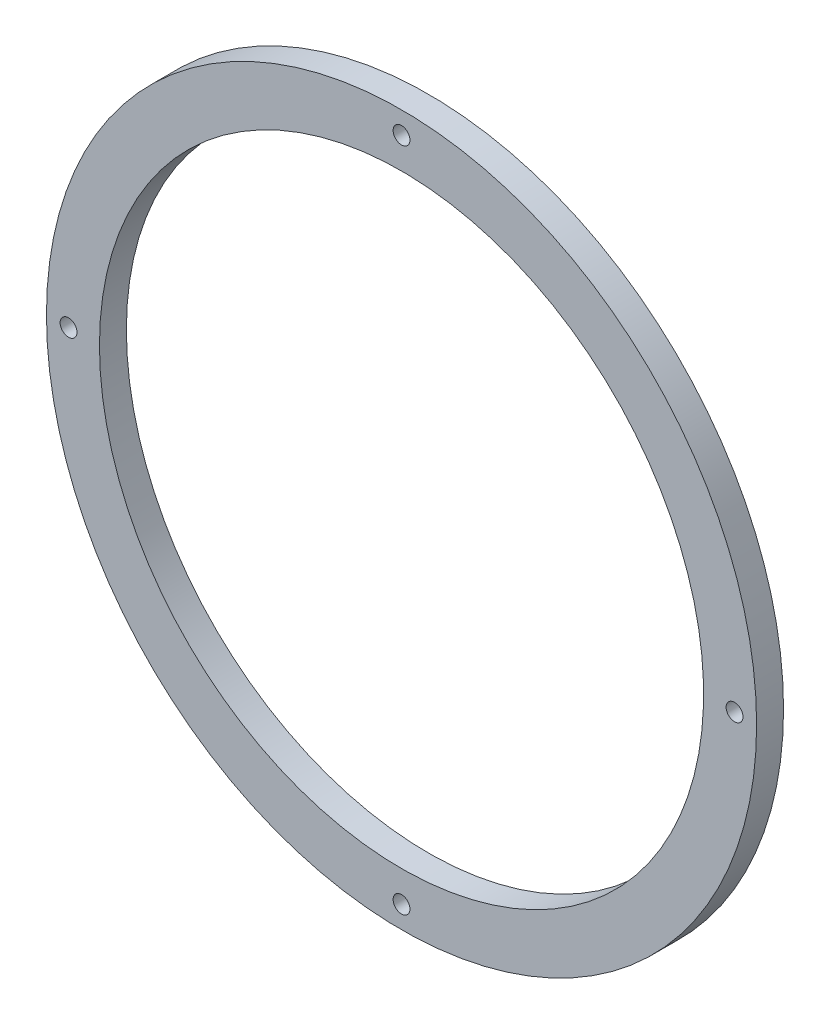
ISO-10303-21;
HEADER;
FILE_DESCRIPTION(('STEP AP214'),'2;1');
FILE_NAME('part.step','',(''),(''),'','','');
FILE_SCHEMA(('AUTOMOTIVE_DESIGN { 1 0 10303 214 1 1 1 1 }'));
ENDSEC;
DATA;
#1=APPLICATION_CONTEXT('core data for automotive mechanical design processes');
#2=APPLICATION_PROTOCOL_DEFINITION('international standard','automotive_design',2000,#1);
#3=PRODUCT_CONTEXT('',#1,'mechanical');
#4=PRODUCT('Part','Part','',(#3));
#5=PRODUCT_RELATED_PRODUCT_CATEGORY('part','',(#4));
#6=PRODUCT_DEFINITION_FORMATION('','',#4);
#7=PRODUCT_DEFINITION_CONTEXT('part definition',#1,'design');
#8=PRODUCT_DEFINITION('design','',#6,#7);
#9=PRODUCT_DEFINITION_SHAPE('','',#8);
#10=(LENGTH_UNIT() NAMED_UNIT(*) SI_UNIT(.MILLI.,.METRE.));
#11=(NAMED_UNIT(*) PLANE_ANGLE_UNIT() SI_UNIT($,.RADIAN.));
#12=(NAMED_UNIT(*) SI_UNIT($,.STERADIAN.) SOLID_ANGLE_UNIT());
#13=UNCERTAINTY_MEASURE_WITH_UNIT(LENGTH_MEASURE(1.E-05),#10,'distance_accuracy_value','');
#14=(GEOMETRIC_REPRESENTATION_CONTEXT(3) GLOBAL_UNCERTAINTY_ASSIGNED_CONTEXT((#13)) GLOBAL_UNIT_ASSIGNED_CONTEXT((#10,
#11,#12)) REPRESENTATION_CONTEXT('',''));
#15=CARTESIAN_POINT('',(0.,0.,0.));
#16=DIRECTION('',(0.,0.,1.));
#17=DIRECTION('',(1.,0.,0.));
#18=AXIS2_PLACEMENT_3D('',#15,#16,#17);
#19=CARTESIAN_POINT('',(0.,0.,7.62));
#20=DIRECTION('',(0.,0.,1.));
#21=DIRECTION('',(1.,0.,0.));
#22=AXIS2_PLACEMENT_3D('',#19,#20,#21);
#23=PLANE('',#22);
#24=CARTESIAN_POINT('',(0.,-94.25,7.62));
#25=DIRECTION('',(0.,0.,1.));
#26=DIRECTION('',(1.,0.,0.));
#27=AXIS2_PLACEMENT_3D('',#24,#25,#26);
#28=CIRCLE('',#27,2.38125);
#29=CARTESIAN_POINT('',(-2.38124999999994,-94.25,7.62));
#30=VERTEX_POINT('',#29);
#31=EDGE_CURVE('E59',#30,#30,#28,.T.);
#32=ORIENTED_EDGE('',*,*,#31,.F.);
#33=EDGE_LOOP('',(#32));
#34=FACE_BOUND('',#33,.T.);
#35=CARTESIAN_POINT('',(0.,94.25,7.62));
#36=DIRECTION('',(0.,0.,1.));
#37=DIRECTION('',(1.,0.,0.));
#38=AXIS2_PLACEMENT_3D('',#35,#36,#37);
#39=CIRCLE('',#38,2.38125);
#40=CARTESIAN_POINT('',(-2.38125,94.25,7.62));
#41=VERTEX_POINT('',#40);
#42=EDGE_CURVE('E47',#41,#41,#39,.T.);
#43=ORIENTED_EDGE('',*,*,#42,.F.);
#44=EDGE_LOOP('',(#43));
#45=FACE_BOUND('',#44,.T.);
#46=CARTESIAN_POINT('',(0.,0.,7.62));
#47=DIRECTION('',(0.,0.,1.));
#48=DIRECTION('',(1.,0.,0.));
#49=AXIS2_PLACEMENT_3D('',#46,#47,#48);
#50=CIRCLE('',#49,100.5);
#51=CARTESIAN_POINT('',(-100.5,0.,7.62));
#52=VERTEX_POINT('',#51);
#53=EDGE_CURVE('E10',#52,#52,#50,.T.);
#54=ORIENTED_EDGE('',*,*,#53,.T.);
#55=EDGE_LOOP('',(#54));
#56=FACE_BOUND('',#55,.T.);
#57=CARTESIAN_POINT('',(0.,0.,7.62));
#58=DIRECTION('',(0.,0.,1.));
#59=DIRECTION('',(1.,0.,0.));
#60=AXIS2_PLACEMENT_3D('',#57,#58,#59);
#61=CIRCLE('',#60,85.5000000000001);
#62=CARTESIAN_POINT('',(-85.5000000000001,0.,7.62));
#63=VERTEX_POINT('',#62);
#64=EDGE_CURVE('E42',#63,#63,#61,.T.);
#65=ORIENTED_EDGE('',*,*,#64,.F.);
#66=EDGE_LOOP('',(#65));
#67=FACE_BOUND('',#66,.T.);
#68=CARTESIAN_POINT('',(94.25,0.,7.62));
#69=DIRECTION('',(0.,0.,1.));
#70=DIRECTION('',(1.,0.,0.));
#71=AXIS2_PLACEMENT_3D('',#68,#69,#70);
#72=CIRCLE('',#71,2.38125000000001);
#73=CARTESIAN_POINT('',(91.86875,0.,7.62));
#74=VERTEX_POINT('',#73);
#75=EDGE_CURVE('E53',#74,#74,#72,.T.);
#76=ORIENTED_EDGE('',*,*,#75,.F.);
#77=EDGE_LOOP('',(#76));
#78=FACE_BOUND('',#77,.T.);
#79=CARTESIAN_POINT('',(-94.25,0.,7.62));
#80=DIRECTION('',(0.,0.,1.));
#81=DIRECTION('',(1.,0.,0.));
#82=AXIS2_PLACEMENT_3D('',#79,#80,#81);
#83=CIRCLE('',#82,2.38125000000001);
#84=CARTESIAN_POINT('',(-96.63125,0.,7.62));
#85=VERTEX_POINT('',#84);
#86=EDGE_CURVE('E65',#85,#85,#83,.T.);
#87=ORIENTED_EDGE('',*,*,#86,.F.);
#88=EDGE_LOOP('',(#87));
#89=FACE_BOUND('',#88,.T.);
#90=ADVANCED_FACE('F31',(#34,#45,#56,#67,#78,#89),#23,.T.);
#91=CARTESIAN_POINT('',(0.,0.,0.));
#92=DIRECTION('',(0.,0.,1.));
#93=DIRECTION('',(1.,0.,0.));
#94=AXIS2_PLACEMENT_3D('',#91,#92,#93);
#95=PLANE('',#94);
#96=CARTESIAN_POINT('',(0.,0.,0.));
#97=DIRECTION('',(0.,0.,1.));
#98=DIRECTION('',(1.,0.,0.));
#99=AXIS2_PLACEMENT_3D('',#96,#97,#98);
#100=CIRCLE('',#99,100.5);
#101=CARTESIAN_POINT('',(-100.5,0.,0.));
#102=VERTEX_POINT('',#101);
#103=EDGE_CURVE('E35',#102,#102,#100,.T.);
#104=ORIENTED_EDGE('',*,*,#103,.F.);
#105=EDGE_LOOP('',(#104));
#106=FACE_BOUND('',#105,.T.);
#107=CARTESIAN_POINT('',(0.,0.,0.));
#108=DIRECTION('',(0.,0.,1.));
#109=DIRECTION('',(1.,0.,0.));
#110=AXIS2_PLACEMENT_3D('',#107,#108,#109);
#111=CIRCLE('',#110,85.5000000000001);
#112=CARTESIAN_POINT('',(-85.5000000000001,0.,0.));
#113=VERTEX_POINT('',#112);
#114=EDGE_CURVE('E44',#113,#113,#111,.T.);
#115=ORIENTED_EDGE('',*,*,#114,.T.);
#116=EDGE_LOOP('',(#115));
#117=FACE_BOUND('',#116,.T.);
#118=CARTESIAN_POINT('',(0.,94.25,0.));
#119=DIRECTION('',(0.,0.,1.));
#120=DIRECTION('',(1.,0.,0.));
#121=AXIS2_PLACEMENT_3D('',#118,#119,#120);
#122=CIRCLE('',#121,2.38125);
#123=CARTESIAN_POINT('',(-2.38125,94.25,0.));
#124=VERTEX_POINT('',#123);
#125=EDGE_CURVE('E50',#124,#124,#122,.T.);
#126=ORIENTED_EDGE('',*,*,#125,.T.);
#127=EDGE_LOOP('',(#126));
#128=FACE_BOUND('',#127,.T.);
#129=CARTESIAN_POINT('',(94.25,0.,0.));
#130=DIRECTION('',(0.,0.,1.));
#131=DIRECTION('',(1.,0.,0.));
#132=AXIS2_PLACEMENT_3D('',#129,#130,#131);
#133=CIRCLE('',#132,2.38125000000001);
#134=CARTESIAN_POINT('',(91.86875,0.,0.));
#135=VERTEX_POINT('',#134);
#136=EDGE_CURVE('E56',#135,#135,#133,.T.);
#137=ORIENTED_EDGE('',*,*,#136,.T.);
#138=EDGE_LOOP('',(#137));
#139=FACE_BOUND('',#138,.T.);
#140=CARTESIAN_POINT('',(0.,-94.25,0.));
#141=DIRECTION('',(0.,0.,1.));
#142=DIRECTION('',(1.,0.,0.));
#143=AXIS2_PLACEMENT_3D('',#140,#141,#142);
#144=CIRCLE('',#143,2.38125);
#145=CARTESIAN_POINT('',(-2.38124999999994,-94.25,0.));
#146=VERTEX_POINT('',#145);
#147=EDGE_CURVE('E62',#146,#146,#144,.T.);
#148=ORIENTED_EDGE('',*,*,#147,.T.);
#149=EDGE_LOOP('',(#148));
#150=FACE_BOUND('',#149,.T.);
#151=CARTESIAN_POINT('',(-94.25,0.,0.));
#152=DIRECTION('',(0.,0.,1.));
#153=DIRECTION('',(1.,0.,0.));
#154=AXIS2_PLACEMENT_3D('',#151,#152,#153);
#155=CIRCLE('',#154,2.38125000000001);
#156=CARTESIAN_POINT('',(-96.63125,0.,0.));
#157=VERTEX_POINT('',#156);
#158=EDGE_CURVE('E68',#157,#157,#155,.T.);
#159=ORIENTED_EDGE('',*,*,#158,.T.);
#160=EDGE_LOOP('',(#159));
#161=FACE_BOUND('',#160,.T.);
#162=ADVANCED_FACE('F78',(#106,#117,#128,#139,#150,#161),#95,.F.);
#163=CARTESIAN_POINT('',(0.,0.,7.62));
#164=DIRECTION('',(0.,0.,-1.));
#165=DIRECTION('',(-1.,0.,0.));
#166=AXIS2_PLACEMENT_3D('',#163,#164,#165);
#167=CYLINDRICAL_SURFACE('',#166,100.5);
#168=CARTESIAN_POINT('',(-100.5,0.,7.62));
#169=CARTESIAN_POINT('',(-100.5,0.,7.540625));
#170=CARTESIAN_POINT('',(-100.5,0.,7.46125));
#171=CARTESIAN_POINT('',(-100.5,0.,7.3025));
#172=CARTESIAN_POINT('',(-100.5,0.,7.223125));
#173=CARTESIAN_POINT('',(-100.5,0.,7.064375));
#174=CARTESIAN_POINT('',(-100.5,0.,6.985));
#175=CARTESIAN_POINT('',(-100.5,0.,6.82625));
#176=CARTESIAN_POINT('',(-100.5,0.,6.746875));
#177=CARTESIAN_POINT('',(-100.5,0.,6.588125));
#178=CARTESIAN_POINT('',(-100.5,0.,6.50875));
#179=CARTESIAN_POINT('',(-100.5,0.,6.35));
#180=CARTESIAN_POINT('',(-100.5,0.,6.270625));
#181=CARTESIAN_POINT('',(-100.5,0.,6.111875));
#182=CARTESIAN_POINT('',(-100.5,0.,6.0325));
#183=CARTESIAN_POINT('',(-100.5,0.,5.87375));
#184=CARTESIAN_POINT('',(-100.5,0.,5.794375));
#185=CARTESIAN_POINT('',(-100.5,0.,5.635625));
#186=CARTESIAN_POINT('',(-100.5,0.,5.55625));
#187=CARTESIAN_POINT('',(-100.5,0.,5.3975));
#188=CARTESIAN_POINT('',(-100.5,0.,5.318125));
#189=CARTESIAN_POINT('',(-100.5,0.,5.159375));
#190=CARTESIAN_POINT('',(-100.5,0.,5.08));
#191=CARTESIAN_POINT('',(-100.5,0.,4.92125));
#192=CARTESIAN_POINT('',(-100.5,0.,4.841875));
#193=CARTESIAN_POINT('',(-100.5,0.,4.683125));
#194=CARTESIAN_POINT('',(-100.5,0.,4.60375));
#195=CARTESIAN_POINT('',(-100.5,0.,4.445));
#196=CARTESIAN_POINT('',(-100.5,0.,4.365625));
#197=CARTESIAN_POINT('',(-100.5,0.,4.206875));
#198=CARTESIAN_POINT('',(-100.5,0.,4.1275));
#199=CARTESIAN_POINT('',(-100.5,0.,3.96875));
#200=CARTESIAN_POINT('',(-100.5,0.,3.889375));
#201=CARTESIAN_POINT('',(-100.5,0.,3.730625));
#202=CARTESIAN_POINT('',(-100.5,0.,3.65125));
#203=CARTESIAN_POINT('',(-100.5,0.,3.4925));
#204=CARTESIAN_POINT('',(-100.5,0.,3.413125));
#205=CARTESIAN_POINT('',(-100.5,0.,3.254375));
#206=CARTESIAN_POINT('',(-100.5,0.,3.175));
#207=CARTESIAN_POINT('',(-100.5,0.,3.01625));
#208=CARTESIAN_POINT('',(-100.5,0.,2.936875));
#209=CARTESIAN_POINT('',(-100.5,0.,2.778125));
#210=CARTESIAN_POINT('',(-100.5,0.,2.69875));
#211=CARTESIAN_POINT('',(-100.5,0.,2.54));
#212=CARTESIAN_POINT('',(-100.5,0.,2.460625));
#213=CARTESIAN_POINT('',(-100.5,0.,2.301875));
#214=CARTESIAN_POINT('',(-100.5,0.,2.2225));
#215=CARTESIAN_POINT('',(-100.5,0.,2.06375));
#216=CARTESIAN_POINT('',(-100.5,0.,1.984375));
#217=CARTESIAN_POINT('',(-100.5,0.,1.825625));
#218=CARTESIAN_POINT('',(-100.5,0.,1.74625));
#219=CARTESIAN_POINT('',(-100.5,0.,1.5875));
#220=CARTESIAN_POINT('',(-100.5,0.,1.508125));
#221=CARTESIAN_POINT('',(-100.5,0.,1.349375));
#222=CARTESIAN_POINT('',(-100.5,0.,1.27));
#223=CARTESIAN_POINT('',(-100.5,0.,1.11125));
#224=CARTESIAN_POINT('',(-100.5,0.,1.031875));
#225=CARTESIAN_POINT('',(-100.5,0.,0.873125));
#226=CARTESIAN_POINT('',(-100.5,0.,0.79375));
#227=CARTESIAN_POINT('',(-100.5,0.,0.635));
#228=CARTESIAN_POINT('',(-100.5,0.,0.555625));
#229=CARTESIAN_POINT('',(-100.5,0.,0.396875));
#230=CARTESIAN_POINT('',(-100.5,0.,0.3175));
#231=CARTESIAN_POINT('',(-100.5,0.,0.15875));
#232=CARTESIAN_POINT('',(-100.5,0.,0.0793749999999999));
#233=CARTESIAN_POINT('',(-100.5,0.,0.));
#234=B_SPLINE_CURVE_WITH_KNOTS('',3,(#168,#169,#170,#171,#172,#173,#174,#175,#176,#177,#178,
#179,#180,#181,#182,#183,#184,#185,#186,#187,#188,#189,#190,#191,#192,#193,#194,#195,#196,#197,
#198,#199,#200,#201,#202,#203,#204,#205,#206,#207,#208,#209,#210,#211,#212,#213,#214,#215,#216,
#217,#218,#219,#220,#221,#222,#223,#224,#225,#226,#227,#228,#229,#230,#231,#232,#233),
.UNSPECIFIED.,.F.,.F.,(4,2,2,2,2,2,2,2,2,2,2,2,2,2,2,2,2,2,2,2,2,2,2,2,2,2,2,2,2,2,2,2,4),(0.,
0.238125,0.476249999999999,0.714375,0.952499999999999,1.190625,1.42875,1.666875,1.905,2.143125,
2.38125,2.619375,2.8575,3.095625,3.33375,3.571875,3.81,4.048125,4.28625,4.524375,4.7625,
5.000625,5.23875,5.476875,5.715,5.953125,6.19125,6.429375,6.6675,6.905625,7.14375,7.381875,
7.62),.UNSPECIFIED.);
#235=EDGE_CURVE('BSEAM33',#52,#102,#234,.T.);
#236=ORIENTED_EDGE('',*,*,#53,.F.);
#237=ORIENTED_EDGE('',*,*,#103,.T.);
#238=ORIENTED_EDGE('',*,*,#235,.T.);
#239=ORIENTED_EDGE('',*,*,#235,.F.);
#240=EDGE_LOOP('',(#236,#238,#237,#239));
#241=FACE_BOUND('',#240,.T.);
#242=ADVANCED_FACE('F33',(#241),#167,.T.);
#243=CARTESIAN_POINT('',(0.,0.,7.62));
#244=DIRECTION('',(0.,0.,-1.));
#245=DIRECTION('',(-1.,0.,0.));
#246=AXIS2_PLACEMENT_3D('',#243,#244,#245);
#247=CYLINDRICAL_SURFACE('',#246,85.5000000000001);
#248=CARTESIAN_POINT('',(-85.5000000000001,0.,7.62));
#249=CARTESIAN_POINT('',(-85.5000000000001,0.,7.540625));
#250=CARTESIAN_POINT('',(-85.5000000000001,0.,7.46125));
#251=CARTESIAN_POINT('',(-85.5000000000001,0.,7.3025));
#252=CARTESIAN_POINT('',(-85.5000000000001,0.,7.223125));
#253=CARTESIAN_POINT('',(-85.5000000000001,0.,7.064375));
#254=CARTESIAN_POINT('',(-85.5000000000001,0.,6.985));
#255=CARTESIAN_POINT('',(-85.5000000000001,0.,6.82625));
#256=CARTESIAN_POINT('',(-85.5000000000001,0.,6.746875));
#257=CARTESIAN_POINT('',(-85.5000000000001,0.,6.588125));
#258=CARTESIAN_POINT('',(-85.5000000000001,0.,6.50875));
#259=CARTESIAN_POINT('',(-85.5000000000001,0.,6.35));
#260=CARTESIAN_POINT('',(-85.5000000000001,0.,6.270625));
#261=CARTESIAN_POINT('',(-85.5000000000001,0.,6.111875));
#262=CARTESIAN_POINT('',(-85.5000000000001,0.,6.0325));
#263=CARTESIAN_POINT('',(-85.5000000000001,0.,5.87375));
#264=CARTESIAN_POINT('',(-85.5000000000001,0.,5.794375));
#265=CARTESIAN_POINT('',(-85.5000000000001,0.,5.635625));
#266=CARTESIAN_POINT('',(-85.5000000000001,0.,5.55625));
#267=CARTESIAN_POINT('',(-85.5000000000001,0.,5.3975));
#268=CARTESIAN_POINT('',(-85.5000000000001,0.,5.318125));
#269=CARTESIAN_POINT('',(-85.5000000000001,0.,5.159375));
#270=CARTESIAN_POINT('',(-85.5000000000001,0.,5.08));
#271=CARTESIAN_POINT('',(-85.5000000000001,0.,4.92125));
#272=CARTESIAN_POINT('',(-85.5000000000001,0.,4.841875));
#273=CARTESIAN_POINT('',(-85.5000000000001,0.,4.683125));
#274=CARTESIAN_POINT('',(-85.5000000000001,0.,4.60375));
#275=CARTESIAN_POINT('',(-85.5000000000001,0.,4.445));
#276=CARTESIAN_POINT('',(-85.5000000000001,0.,4.365625));
#277=CARTESIAN_POINT('',(-85.5000000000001,0.,4.206875));
#278=CARTESIAN_POINT('',(-85.5000000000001,0.,4.1275));
#279=CARTESIAN_POINT('',(-85.5000000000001,0.,3.96875));
#280=CARTESIAN_POINT('',(-85.5000000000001,0.,3.889375));
#281=CARTESIAN_POINT('',(-85.5000000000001,0.,3.730625));
#282=CARTESIAN_POINT('',(-85.5000000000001,0.,3.65125));
#283=CARTESIAN_POINT('',(-85.5000000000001,0.,3.4925));
#284=CARTESIAN_POINT('',(-85.5000000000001,0.,3.413125));
#285=CARTESIAN_POINT('',(-85.5000000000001,0.,3.254375));
#286=CARTESIAN_POINT('',(-85.5000000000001,0.,3.175));
#287=CARTESIAN_POINT('',(-85.5000000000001,0.,3.01625));
#288=CARTESIAN_POINT('',(-85.5000000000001,0.,2.936875));
#289=CARTESIAN_POINT('',(-85.5000000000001,0.,2.778125));
#290=CARTESIAN_POINT('',(-85.5000000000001,0.,2.69875));
#291=CARTESIAN_POINT('',(-85.5000000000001,0.,2.54));
#292=CARTESIAN_POINT('',(-85.5000000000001,0.,2.460625));
#293=CARTESIAN_POINT('',(-85.5000000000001,0.,2.301875));
#294=CARTESIAN_POINT('',(-85.5000000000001,0.,2.2225));
#295=CARTESIAN_POINT('',(-85.5000000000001,0.,2.06375));
#296=CARTESIAN_POINT('',(-85.5000000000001,0.,1.984375));
#297=CARTESIAN_POINT('',(-85.5000000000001,0.,1.825625));
#298=CARTESIAN_POINT('',(-85.5000000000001,0.,1.74625));
#299=CARTESIAN_POINT('',(-85.5000000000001,0.,1.5875));
#300=CARTESIAN_POINT('',(-85.5000000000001,0.,1.508125));
#301=CARTESIAN_POINT('',(-85.5000000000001,0.,1.349375));
#302=CARTESIAN_POINT('',(-85.5000000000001,0.,1.27));
#303=CARTESIAN_POINT('',(-85.5000000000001,0.,1.11125));
#304=CARTESIAN_POINT('',(-85.5000000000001,0.,1.031875));
#305=CARTESIAN_POINT('',(-85.5000000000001,0.,0.873125));
#306=CARTESIAN_POINT('',(-85.5000000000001,0.,0.79375));
#307=CARTESIAN_POINT('',(-85.5000000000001,0.,0.635));
#308=CARTESIAN_POINT('',(-85.5000000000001,0.,0.555625));
#309=CARTESIAN_POINT('',(-85.5000000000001,0.,0.396875));
#310=CARTESIAN_POINT('',(-85.5000000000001,0.,0.3175));
#311=CARTESIAN_POINT('',(-85.5000000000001,0.,0.15875));
#312=CARTESIAN_POINT('',(-85.5000000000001,0.,0.0793749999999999));
#313=CARTESIAN_POINT('',(-85.5000000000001,0.,0.));
#314=B_SPLINE_CURVE_WITH_KNOTS('',3,(#248,#249,#250,#251,#252,#253,#254,#255,#256,#257,#258,
#259,#260,#261,#262,#263,#264,#265,#266,#267,#268,#269,#270,#271,#272,#273,#274,#275,#276,#277,
#278,#279,#280,#281,#282,#283,#284,#285,#286,#287,#288,#289,#290,#291,#292,#293,#294,#295,#296,
#297,#298,#299,#300,#301,#302,#303,#304,#305,#306,#307,#308,#309,#310,#311,#312,#313),
.UNSPECIFIED.,.F.,.F.,(4,2,2,2,2,2,2,2,2,2,2,2,2,2,2,2,2,2,2,2,2,2,2,2,2,2,2,2,2,2,2,2,4),(0.,
0.238125,0.476249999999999,0.714375,0.952499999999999,1.190625,1.42875,1.666875,1.905,2.143125,
2.38125,2.619375,2.8575,3.095625,3.33375,3.571875,3.81,4.048125,4.28625,4.524375,4.7625,
5.000625,5.23875,5.476875,5.715,5.953125,6.19125,6.429375,6.6675,6.905625,7.14375,7.381875,
7.62),.UNSPECIFIED.);
#315=EDGE_CURVE('BSEAM88',#63,#113,#314,.T.);
#316=ORIENTED_EDGE('',*,*,#64,.T.);
#317=ORIENTED_EDGE('',*,*,#114,.F.);
#318=ORIENTED_EDGE('',*,*,#315,.T.);
#319=ORIENTED_EDGE('',*,*,#315,.F.);
#320=EDGE_LOOP('',(#316,#318,#317,#319));
#321=FACE_BOUND('',#320,.T.);
#322=ADVANCED_FACE('F88',(#321),#247,.F.);
#323=CARTESIAN_POINT('',(0.,94.25,7.62));
#324=DIRECTION('',(0.,0.,-1.));
#325=DIRECTION('',(-1.,0.,0.));
#326=AXIS2_PLACEMENT_3D('',#323,#324,#325);
#327=CYLINDRICAL_SURFACE('',#326,2.38125);
#328=CARTESIAN_POINT('',(-2.38125,94.25,7.62));
#329=CARTESIAN_POINT('',(-2.38125,94.25,7.540625));
#330=CARTESIAN_POINT('',(-2.38125,94.25,7.46125));
#331=CARTESIAN_POINT('',(-2.38125,94.25,7.3025));
#332=CARTESIAN_POINT('',(-2.38125,94.25,7.223125));
#333=CARTESIAN_POINT('',(-2.38125,94.25,7.064375));
#334=CARTESIAN_POINT('',(-2.38125,94.25,6.985));
#335=CARTESIAN_POINT('',(-2.38125,94.25,6.82625));
#336=CARTESIAN_POINT('',(-2.38125,94.25,6.746875));
#337=CARTESIAN_POINT('',(-2.38125,94.25,6.588125));
#338=CARTESIAN_POINT('',(-2.38125,94.25,6.50875));
#339=CARTESIAN_POINT('',(-2.38125,94.25,6.35));
#340=CARTESIAN_POINT('',(-2.38125,94.25,6.270625));
#341=CARTESIAN_POINT('',(-2.38125,94.25,6.111875));
#342=CARTESIAN_POINT('',(-2.38125,94.25,6.0325));
#343=CARTESIAN_POINT('',(-2.38125,94.25,5.87375));
#344=CARTESIAN_POINT('',(-2.38125,94.25,5.794375));
#345=CARTESIAN_POINT('',(-2.38125,94.25,5.635625));
#346=CARTESIAN_POINT('',(-2.38125,94.25,5.55625));
#347=CARTESIAN_POINT('',(-2.38125,94.25,5.3975));
#348=CARTESIAN_POINT('',(-2.38125,94.25,5.318125));
#349=CARTESIAN_POINT('',(-2.38125,94.25,5.159375));
#350=CARTESIAN_POINT('',(-2.38125,94.25,5.08));
#351=CARTESIAN_POINT('',(-2.38125,94.25,4.92125));
#352=CARTESIAN_POINT('',(-2.38125,94.25,4.841875));
#353=CARTESIAN_POINT('',(-2.38125,94.25,4.683125));
#354=CARTESIAN_POINT('',(-2.38125,94.25,4.60375));
#355=CARTESIAN_POINT('',(-2.38125,94.25,4.445));
#356=CARTESIAN_POINT('',(-2.38125,94.25,4.365625));
#357=CARTESIAN_POINT('',(-2.38125,94.25,4.206875));
#358=CARTESIAN_POINT('',(-2.38125,94.25,4.1275));
#359=CARTESIAN_POINT('',(-2.38125,94.25,3.96875));
#360=CARTESIAN_POINT('',(-2.38125,94.25,3.889375));
#361=CARTESIAN_POINT('',(-2.38125,94.25,3.730625));
#362=CARTESIAN_POINT('',(-2.38125,94.25,3.65125));
#363=CARTESIAN_POINT('',(-2.38125,94.25,3.4925));
#364=CARTESIAN_POINT('',(-2.38125,94.25,3.413125));
#365=CARTESIAN_POINT('',(-2.38125,94.25,3.254375));
#366=CARTESIAN_POINT('',(-2.38125,94.25,3.175));
#367=CARTESIAN_POINT('',(-2.38125,94.25,3.01625));
#368=CARTESIAN_POINT('',(-2.38125,94.25,2.936875));
#369=CARTESIAN_POINT('',(-2.38125,94.25,2.778125));
#370=CARTESIAN_POINT('',(-2.38125,94.25,2.69875));
#371=CARTESIAN_POINT('',(-2.38125,94.25,2.54));
#372=CARTESIAN_POINT('',(-2.38125,94.25,2.460625));
#373=CARTESIAN_POINT('',(-2.38125,94.25,2.301875));
#374=CARTESIAN_POINT('',(-2.38125,94.25,2.2225));
#375=CARTESIAN_POINT('',(-2.38125,94.25,2.06375));
#376=CARTESIAN_POINT('',(-2.38125,94.25,1.984375));
#377=CARTESIAN_POINT('',(-2.38125,94.25,1.825625));
#378=CARTESIAN_POINT('',(-2.38125,94.25,1.74625));
#379=CARTESIAN_POINT('',(-2.38125,94.25,1.5875));
#380=CARTESIAN_POINT('',(-2.38125,94.25,1.508125));
#381=CARTESIAN_POINT('',(-2.38125,94.25,1.349375));
#382=CARTESIAN_POINT('',(-2.38125,94.25,1.27));
#383=CARTESIAN_POINT('',(-2.38125,94.25,1.11125));
#384=CARTESIAN_POINT('',(-2.38125,94.25,1.031875));
#385=CARTESIAN_POINT('',(-2.38125,94.25,0.873125));
#386=CARTESIAN_POINT('',(-2.38125,94.25,0.79375));
#387=CARTESIAN_POINT('',(-2.38125,94.25,0.635));
#388=CARTESIAN_POINT('',(-2.38125,94.25,0.555625));
#389=CARTESIAN_POINT('',(-2.38125,94.25,0.396875));
#390=CARTESIAN_POINT('',(-2.38125,94.25,0.3175));
#391=CARTESIAN_POINT('',(-2.38125,94.25,0.15875));
#392=CARTESIAN_POINT('',(-2.38125,94.25,0.0793749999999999));
#393=CARTESIAN_POINT('',(-2.38125,94.25,0.));
#394=B_SPLINE_CURVE_WITH_KNOTS('',3,(#328,#329,#330,#331,#332,#333,#334,#335,#336,#337,#338,
#339,#340,#341,#342,#343,#344,#345,#346,#347,#348,#349,#350,#351,#352,#353,#354,#355,#356,#357,
#358,#359,#360,#361,#362,#363,#364,#365,#366,#367,#368,#369,#370,#371,#372,#373,#374,#375,#376,
#377,#378,#379,#380,#381,#382,#383,#384,#385,#386,#387,#388,#389,#390,#391,#392,#393),
.UNSPECIFIED.,.F.,.F.,(4,2,2,2,2,2,2,2,2,2,2,2,2,2,2,2,2,2,2,2,2,2,2,2,2,2,2,2,2,2,2,2,4),(0.,
0.238125,0.47625,0.714375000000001,0.9525,1.190625,1.42875,1.666875,1.905,2.143125,2.38125,
2.619375,2.8575,3.095625,3.33375,3.571875,3.81,4.048125,4.28625,4.524375,4.7625,5.000625,
5.23875,5.476875,5.715,5.953125,6.19125,6.429375,6.6675,6.905625,7.14375,7.381875,7.62),.UNSPECIFIED.);
#395=EDGE_CURVE('BSEAM91',#41,#124,#394,.T.);
#396=ORIENTED_EDGE('',*,*,#42,.T.);
#397=ORIENTED_EDGE('',*,*,#125,.F.);
#398=ORIENTED_EDGE('',*,*,#395,.T.);
#399=ORIENTED_EDGE('',*,*,#395,.F.);
#400=EDGE_LOOP('',(#396,#398,#397,#399));
#401=FACE_BOUND('',#400,.T.);
#402=ADVANCED_FACE('F91',(#401),#327,.F.);
#403=CARTESIAN_POINT('',(94.25,0.,7.62));
#404=DIRECTION('',(0.,0.,-1.));
#405=DIRECTION('',(-1.,0.,0.));
#406=AXIS2_PLACEMENT_3D('',#403,#404,#405);
#407=CYLINDRICAL_SURFACE('',#406,2.38125000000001);
#408=CARTESIAN_POINT('',(91.86875,0.,7.62));
#409=CARTESIAN_POINT('',(91.86875,0.,7.540625));
#410=CARTESIAN_POINT('',(91.86875,0.,7.46125));
#411=CARTESIAN_POINT('',(91.86875,0.,7.3025));
#412=CARTESIAN_POINT('',(91.86875,0.,7.223125));
#413=CARTESIAN_POINT('',(91.86875,0.,7.064375));
#414=CARTESIAN_POINT('',(91.86875,0.,6.985));
#415=CARTESIAN_POINT('',(91.86875,0.,6.82625));
#416=CARTESIAN_POINT('',(91.86875,0.,6.746875));
#417=CARTESIAN_POINT('',(91.86875,0.,6.588125));
#418=CARTESIAN_POINT('',(91.86875,0.,6.50875));
#419=CARTESIAN_POINT('',(91.86875,0.,6.35));
#420=CARTESIAN_POINT('',(91.86875,0.,6.270625));
#421=CARTESIAN_POINT('',(91.86875,0.,6.111875));
#422=CARTESIAN_POINT('',(91.86875,0.,6.0325));
#423=CARTESIAN_POINT('',(91.86875,0.,5.87375));
#424=CARTESIAN_POINT('',(91.86875,0.,5.794375));
#425=CARTESIAN_POINT('',(91.86875,0.,5.635625));
#426=CARTESIAN_POINT('',(91.86875,0.,5.55625));
#427=CARTESIAN_POINT('',(91.86875,0.,5.3975));
#428=CARTESIAN_POINT('',(91.86875,0.,5.318125));
#429=CARTESIAN_POINT('',(91.86875,0.,5.159375));
#430=CARTESIAN_POINT('',(91.86875,0.,5.08));
#431=CARTESIAN_POINT('',(91.86875,0.,4.92125));
#432=CARTESIAN_POINT('',(91.86875,0.,4.841875));
#433=CARTESIAN_POINT('',(91.86875,0.,4.683125));
#434=CARTESIAN_POINT('',(91.86875,0.,4.60375));
#435=CARTESIAN_POINT('',(91.86875,0.,4.445));
#436=CARTESIAN_POINT('',(91.86875,0.,4.365625));
#437=CARTESIAN_POINT('',(91.86875,0.,4.206875));
#438=CARTESIAN_POINT('',(91.86875,0.,4.1275));
#439=CARTESIAN_POINT('',(91.86875,0.,3.96875));
#440=CARTESIAN_POINT('',(91.86875,0.,3.889375));
#441=CARTESIAN_POINT('',(91.86875,0.,3.730625));
#442=CARTESIAN_POINT('',(91.86875,0.,3.65125));
#443=CARTESIAN_POINT('',(91.86875,0.,3.4925));
#444=CARTESIAN_POINT('',(91.86875,0.,3.413125));
#445=CARTESIAN_POINT('',(91.86875,0.,3.254375));
#446=CARTESIAN_POINT('',(91.86875,0.,3.175));
#447=CARTESIAN_POINT('',(91.86875,0.,3.01625));
#448=CARTESIAN_POINT('',(91.86875,0.,2.936875));
#449=CARTESIAN_POINT('',(91.86875,0.,2.778125));
#450=CARTESIAN_POINT('',(91.86875,0.,2.69875));
#451=CARTESIAN_POINT('',(91.86875,0.,2.54));
#452=CARTESIAN_POINT('',(91.86875,0.,2.460625));
#453=CARTESIAN_POINT('',(91.86875,0.,2.301875));
#454=CARTESIAN_POINT('',(91.86875,0.,2.2225));
#455=CARTESIAN_POINT('',(91.86875,0.,2.06375));
#456=CARTESIAN_POINT('',(91.86875,0.,1.984375));
#457=CARTESIAN_POINT('',(91.86875,0.,1.825625));
#458=CARTESIAN_POINT('',(91.86875,0.,1.74625));
#459=CARTESIAN_POINT('',(91.86875,0.,1.5875));
#460=CARTESIAN_POINT('',(91.86875,0.,1.508125));
#461=CARTESIAN_POINT('',(91.86875,0.,1.349375));
#462=CARTESIAN_POINT('',(91.86875,0.,1.27));
#463=CARTESIAN_POINT('',(91.86875,0.,1.11125));
#464=CARTESIAN_POINT('',(91.86875,0.,1.031875));
#465=CARTESIAN_POINT('',(91.86875,0.,0.873125));
#466=CARTESIAN_POINT('',(91.86875,0.,0.79375));
#467=CARTESIAN_POINT('',(91.86875,0.,0.635));
#468=CARTESIAN_POINT('',(91.86875,0.,0.555625));
#469=CARTESIAN_POINT('',(91.86875,0.,0.396875));
#470=CARTESIAN_POINT('',(91.86875,0.,0.3175));
#471=CARTESIAN_POINT('',(91.86875,0.,0.15875));
#472=CARTESIAN_POINT('',(91.86875,0.,0.0793749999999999));
#473=CARTESIAN_POINT('',(91.86875,0.,0.));
#474=B_SPLINE_CURVE_WITH_KNOTS('',3,(#408,#409,#410,#411,#412,#413,#414,#415,#416,#417,#418,
#419,#420,#421,#422,#423,#424,#425,#426,#427,#428,#429,#430,#431,#432,#433,#434,#435,#436,#437,
#438,#439,#440,#441,#442,#443,#444,#445,#446,#447,#448,#449,#450,#451,#452,#453,#454,#455,#456,
#457,#458,#459,#460,#461,#462,#463,#464,#465,#466,#467,#468,#469,#470,#471,#472,#473),
.UNSPECIFIED.,.F.,.F.,(4,2,2,2,2,2,2,2,2,2,2,2,2,2,2,2,2,2,2,2,2,2,2,2,2,2,2,2,2,2,2,2,4),(0.,
0.238125,0.47625,0.714375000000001,0.9525,1.190625,1.42875,1.666875,1.905,2.143125,2.38125,
2.619375,2.8575,3.095625,3.33375,3.571875,3.81,4.048125,4.28625,4.524375,4.7625,5.000625,
5.23875,5.476875,5.715,5.953125,6.19125,6.429375,6.6675,6.905625,7.14375,7.381875,7.62),.UNSPECIFIED.);
#475=EDGE_CURVE('BSEAM95',#74,#135,#474,.T.);
#476=ORIENTED_EDGE('',*,*,#75,.T.);
#477=ORIENTED_EDGE('',*,*,#136,.F.);
#478=ORIENTED_EDGE('',*,*,#475,.T.);
#479=ORIENTED_EDGE('',*,*,#475,.F.);
#480=EDGE_LOOP('',(#476,#478,#477,#479));
#481=FACE_BOUND('',#480,.T.);
#482=ADVANCED_FACE('F95',(#481),#407,.F.);
#483=CARTESIAN_POINT('',(0.,-94.25,7.62));
#484=DIRECTION('',(0.,0.,-1.));
#485=DIRECTION('',(-1.,0.,0.));
#486=AXIS2_PLACEMENT_3D('',#483,#484,#485);
#487=CYLINDRICAL_SURFACE('',#486,2.38125);
#488=CARTESIAN_POINT('',(-2.38124999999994,-94.25,7.62));
#489=CARTESIAN_POINT('',(-2.38124999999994,-94.25,7.540625));
#490=CARTESIAN_POINT('',(-2.38124999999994,-94.25,7.46125));
#491=CARTESIAN_POINT('',(-2.38124999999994,-94.25,7.3025));
#492=CARTESIAN_POINT('',(-2.38124999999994,-94.25,7.223125));
#493=CARTESIAN_POINT('',(-2.38124999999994,-94.25,7.064375));
#494=CARTESIAN_POINT('',(-2.38124999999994,-94.25,6.985));
#495=CARTESIAN_POINT('',(-2.38124999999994,-94.25,6.82625));
#496=CARTESIAN_POINT('',(-2.38124999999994,-94.25,6.746875));
#497=CARTESIAN_POINT('',(-2.38124999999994,-94.25,6.588125));
#498=CARTESIAN_POINT('',(-2.38124999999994,-94.25,6.50875));
#499=CARTESIAN_POINT('',(-2.38124999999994,-94.25,6.35));
#500=CARTESIAN_POINT('',(-2.38124999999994,-94.25,6.270625));
#501=CARTESIAN_POINT('',(-2.38124999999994,-94.25,6.111875));
#502=CARTESIAN_POINT('',(-2.38124999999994,-94.25,6.0325));
#503=CARTESIAN_POINT('',(-2.38124999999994,-94.25,5.87375));
#504=CARTESIAN_POINT('',(-2.38124999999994,-94.25,5.794375));
#505=CARTESIAN_POINT('',(-2.38124999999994,-94.25,5.635625));
#506=CARTESIAN_POINT('',(-2.38124999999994,-94.25,5.55625));
#507=CARTESIAN_POINT('',(-2.38124999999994,-94.25,5.3975));
#508=CARTESIAN_POINT('',(-2.38124999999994,-94.25,5.318125));
#509=CARTESIAN_POINT('',(-2.38124999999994,-94.25,5.159375));
#510=CARTESIAN_POINT('',(-2.38124999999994,-94.25,5.08));
#511=CARTESIAN_POINT('',(-2.38124999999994,-94.25,4.92125));
#512=CARTESIAN_POINT('',(-2.38124999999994,-94.25,4.841875));
#513=CARTESIAN_POINT('',(-2.38124999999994,-94.25,4.683125));
#514=CARTESIAN_POINT('',(-2.38124999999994,-94.25,4.60375));
#515=CARTESIAN_POINT('',(-2.38124999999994,-94.25,4.445));
#516=CARTESIAN_POINT('',(-2.38124999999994,-94.25,4.365625));
#517=CARTESIAN_POINT('',(-2.38124999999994,-94.25,4.206875));
#518=CARTESIAN_POINT('',(-2.38124999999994,-94.25,4.1275));
#519=CARTESIAN_POINT('',(-2.38124999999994,-94.25,3.96875));
#520=CARTESIAN_POINT('',(-2.38124999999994,-94.25,3.889375));
#521=CARTESIAN_POINT('',(-2.38124999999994,-94.25,3.730625));
#522=CARTESIAN_POINT('',(-2.38124999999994,-94.25,3.65125));
#523=CARTESIAN_POINT('',(-2.38124999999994,-94.25,3.4925));
#524=CARTESIAN_POINT('',(-2.38124999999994,-94.25,3.413125));
#525=CARTESIAN_POINT('',(-2.38124999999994,-94.25,3.254375));
#526=CARTESIAN_POINT('',(-2.38124999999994,-94.25,3.175));
#527=CARTESIAN_POINT('',(-2.38124999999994,-94.25,3.01625));
#528=CARTESIAN_POINT('',(-2.38124999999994,-94.25,2.936875));
#529=CARTESIAN_POINT('',(-2.38124999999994,-94.25,2.778125));
#530=CARTESIAN_POINT('',(-2.38124999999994,-94.25,2.69875));
#531=CARTESIAN_POINT('',(-2.38124999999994,-94.25,2.54));
#532=CARTESIAN_POINT('',(-2.38124999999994,-94.25,2.460625));
#533=CARTESIAN_POINT('',(-2.38124999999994,-94.25,2.301875));
#534=CARTESIAN_POINT('',(-2.38124999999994,-94.25,2.2225));
#535=CARTESIAN_POINT('',(-2.38124999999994,-94.25,2.06375));
#536=CARTESIAN_POINT('',(-2.38124999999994,-94.25,1.984375));
#537=CARTESIAN_POINT('',(-2.38124999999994,-94.25,1.825625));
#538=CARTESIAN_POINT('',(-2.38124999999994,-94.25,1.74625));
#539=CARTESIAN_POINT('',(-2.38124999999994,-94.25,1.5875));
#540=CARTESIAN_POINT('',(-2.38124999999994,-94.25,1.508125));
#541=CARTESIAN_POINT('',(-2.38124999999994,-94.25,1.349375));
#542=CARTESIAN_POINT('',(-2.38124999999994,-94.25,1.27));
#543=CARTESIAN_POINT('',(-2.38124999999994,-94.25,1.11125));
#544=CARTESIAN_POINT('',(-2.38124999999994,-94.25,1.031875));
#545=CARTESIAN_POINT('',(-2.38124999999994,-94.25,0.873125));
#546=CARTESIAN_POINT('',(-2.38124999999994,-94.25,0.79375));
#547=CARTESIAN_POINT('',(-2.38124999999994,-94.25,0.635));
#548=CARTESIAN_POINT('',(-2.38124999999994,-94.25,0.555625));
#549=CARTESIAN_POINT('',(-2.38124999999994,-94.25,0.396875));
#550=CARTESIAN_POINT('',(-2.38124999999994,-94.25,0.3175));
#551=CARTESIAN_POINT('',(-2.38124999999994,-94.25,0.15875));
#552=CARTESIAN_POINT('',(-2.38124999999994,-94.25,0.0793749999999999));
#553=CARTESIAN_POINT('',(-2.38124999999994,-94.25,0.));
#554=B_SPLINE_CURVE_WITH_KNOTS('',3,(#488,#489,#490,#491,#492,#493,#494,#495,#496,#497,#498,
#499,#500,#501,#502,#503,#504,#505,#506,#507,#508,#509,#510,#511,#512,#513,#514,#515,#516,#517,
#518,#519,#520,#521,#522,#523,#524,#525,#526,#527,#528,#529,#530,#531,#532,#533,#534,#535,#536,
#537,#538,#539,#540,#541,#542,#543,#544,#545,#546,#547,#548,#549,#550,#551,#552,#553),
.UNSPECIFIED.,.F.,.F.,(4,2,2,2,2,2,2,2,2,2,2,2,2,2,2,2,2,2,2,2,2,2,2,2,2,2,2,2,2,2,2,2,4),(0.,
0.238125,0.47625,0.714375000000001,0.9525,1.190625,1.42875,1.666875,1.905,2.143125,2.38125,
2.619375,2.8575,3.095625,3.33375,3.571875,3.81,4.048125,4.28625,4.524375,4.7625,5.000625,
5.23875,5.476875,5.715,5.953125,6.19125,6.429375,6.6675,6.905625,7.14375,7.381875,7.62),.UNSPECIFIED.);
#555=EDGE_CURVE('BSEAM99',#30,#146,#554,.T.);
#556=ORIENTED_EDGE('',*,*,#31,.T.);
#557=ORIENTED_EDGE('',*,*,#147,.F.);
#558=ORIENTED_EDGE('',*,*,#555,.T.);
#559=ORIENTED_EDGE('',*,*,#555,.F.);
#560=EDGE_LOOP('',(#556,#558,#557,#559));
#561=FACE_BOUND('',#560,.T.);
#562=ADVANCED_FACE('F99',(#561),#487,.F.);
#563=CARTESIAN_POINT('',(-94.25,0.,7.62));
#564=DIRECTION('',(0.,0.,-1.));
#565=DIRECTION('',(-1.,0.,0.));
#566=AXIS2_PLACEMENT_3D('',#563,#564,#565);
#567=CYLINDRICAL_SURFACE('',#566,2.38125000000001);
#568=CARTESIAN_POINT('',(-96.63125,0.,7.62));
#569=CARTESIAN_POINT('',(-96.63125,0.,7.540625));
#570=CARTESIAN_POINT('',(-96.63125,0.,7.46125));
#571=CARTESIAN_POINT('',(-96.63125,0.,7.3025));
#572=CARTESIAN_POINT('',(-96.63125,0.,7.223125));
#573=CARTESIAN_POINT('',(-96.63125,0.,7.064375));
#574=CARTESIAN_POINT('',(-96.63125,0.,6.985));
#575=CARTESIAN_POINT('',(-96.63125,0.,6.82625));
#576=CARTESIAN_POINT('',(-96.63125,0.,6.746875));
#577=CARTESIAN_POINT('',(-96.63125,0.,6.588125));
#578=CARTESIAN_POINT('',(-96.63125,0.,6.50875));
#579=CARTESIAN_POINT('',(-96.63125,0.,6.35));
#580=CARTESIAN_POINT('',(-96.63125,0.,6.270625));
#581=CARTESIAN_POINT('',(-96.63125,0.,6.111875));
#582=CARTESIAN_POINT('',(-96.63125,0.,6.0325));
#583=CARTESIAN_POINT('',(-96.63125,0.,5.87375));
#584=CARTESIAN_POINT('',(-96.63125,0.,5.794375));
#585=CARTESIAN_POINT('',(-96.63125,0.,5.635625));
#586=CARTESIAN_POINT('',(-96.63125,0.,5.55625));
#587=CARTESIAN_POINT('',(-96.63125,0.,5.3975));
#588=CARTESIAN_POINT('',(-96.63125,0.,5.318125));
#589=CARTESIAN_POINT('',(-96.63125,0.,5.159375));
#590=CARTESIAN_POINT('',(-96.63125,0.,5.08));
#591=CARTESIAN_POINT('',(-96.63125,0.,4.92125));
#592=CARTESIAN_POINT('',(-96.63125,0.,4.841875));
#593=CARTESIAN_POINT('',(-96.63125,0.,4.683125));
#594=CARTESIAN_POINT('',(-96.63125,0.,4.60375));
#595=CARTESIAN_POINT('',(-96.63125,0.,4.445));
#596=CARTESIAN_POINT('',(-96.63125,0.,4.365625));
#597=CARTESIAN_POINT('',(-96.63125,0.,4.206875));
#598=CARTESIAN_POINT('',(-96.63125,0.,4.1275));
#599=CARTESIAN_POINT('',(-96.63125,0.,3.96875));
#600=CARTESIAN_POINT('',(-96.63125,0.,3.889375));
#601=CARTESIAN_POINT('',(-96.63125,0.,3.730625));
#602=CARTESIAN_POINT('',(-96.63125,0.,3.65125));
#603=CARTESIAN_POINT('',(-96.63125,0.,3.4925));
#604=CARTESIAN_POINT('',(-96.63125,0.,3.413125));
#605=CARTESIAN_POINT('',(-96.63125,0.,3.254375));
#606=CARTESIAN_POINT('',(-96.63125,0.,3.175));
#607=CARTESIAN_POINT('',(-96.63125,0.,3.01625));
#608=CARTESIAN_POINT('',(-96.63125,0.,2.936875));
#609=CARTESIAN_POINT('',(-96.63125,0.,2.778125));
#610=CARTESIAN_POINT('',(-96.63125,0.,2.69875));
#611=CARTESIAN_POINT('',(-96.63125,0.,2.54));
#612=CARTESIAN_POINT('',(-96.63125,0.,2.460625));
#613=CARTESIAN_POINT('',(-96.63125,0.,2.301875));
#614=CARTESIAN_POINT('',(-96.63125,0.,2.2225));
#615=CARTESIAN_POINT('',(-96.63125,0.,2.06375));
#616=CARTESIAN_POINT('',(-96.63125,0.,1.984375));
#617=CARTESIAN_POINT('',(-96.63125,0.,1.825625));
#618=CARTESIAN_POINT('',(-96.63125,0.,1.74625));
#619=CARTESIAN_POINT('',(-96.63125,0.,1.5875));
#620=CARTESIAN_POINT('',(-96.63125,0.,1.508125));
#621=CARTESIAN_POINT('',(-96.63125,0.,1.349375));
#622=CARTESIAN_POINT('',(-96.63125,0.,1.27));
#623=CARTESIAN_POINT('',(-96.63125,0.,1.11125));
#624=CARTESIAN_POINT('',(-96.63125,0.,1.031875));
#625=CARTESIAN_POINT('',(-96.63125,0.,0.873125));
#626=CARTESIAN_POINT('',(-96.63125,0.,0.79375));
#627=CARTESIAN_POINT('',(-96.63125,0.,0.635));
#628=CARTESIAN_POINT('',(-96.63125,0.,0.555625));
#629=CARTESIAN_POINT('',(-96.63125,0.,0.396875));
#630=CARTESIAN_POINT('',(-96.63125,0.,0.3175));
#631=CARTESIAN_POINT('',(-96.63125,0.,0.15875));
#632=CARTESIAN_POINT('',(-96.63125,0.,0.0793749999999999));
#633=CARTESIAN_POINT('',(-96.63125,0.,0.));
#634=B_SPLINE_CURVE_WITH_KNOTS('',3,(#568,#569,#570,#571,#572,#573,#574,#575,#576,#577,#578,
#579,#580,#581,#582,#583,#584,#585,#586,#587,#588,#589,#590,#591,#592,#593,#594,#595,#596,#597,
#598,#599,#600,#601,#602,#603,#604,#605,#606,#607,#608,#609,#610,#611,#612,#613,#614,#615,#616,
#617,#618,#619,#620,#621,#622,#623,#624,#625,#626,#627,#628,#629,#630,#631,#632,#633),
.UNSPECIFIED.,.F.,.F.,(4,2,2,2,2,2,2,2,2,2,2,2,2,2,2,2,2,2,2,2,2,2,2,2,2,2,2,2,2,2,2,2,4),(0.,
0.238125,0.47625,0.714375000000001,0.9525,1.190625,1.42875,1.666875,1.905,2.143125,2.38125,
2.619375,2.8575,3.095625,3.33375,3.571875,3.81,4.048125,4.28625,4.524375,4.7625,5.000625,
5.23875,5.476875,5.715,5.953125,6.19125,6.429375,6.6675,6.905625,7.14375,7.381875,7.62),.UNSPECIFIED.);
#635=EDGE_CURVE('BSEAM74',#85,#157,#634,.T.);
#636=ORIENTED_EDGE('',*,*,#86,.T.);
#637=ORIENTED_EDGE('',*,*,#158,.F.);
#638=ORIENTED_EDGE('',*,*,#635,.T.);
#639=ORIENTED_EDGE('',*,*,#635,.F.);
#640=EDGE_LOOP('',(#636,#638,#637,#639));
#641=FACE_BOUND('',#640,.T.);
#642=ADVANCED_FACE('F74',(#641),#567,.F.);
#643=CLOSED_SHELL('',(#90,#162,#242,#322,#402,#482,#562,#642));
#644=MANIFOLD_SOLID_BREP('B2',#643);
#645=ADVANCED_BREP_SHAPE_REPRESENTATION('',(#18,#644),#14);
#646=SHAPE_DEFINITION_REPRESENTATION(#9,#645);
ENDSEC;
END-ISO-10303-21;
